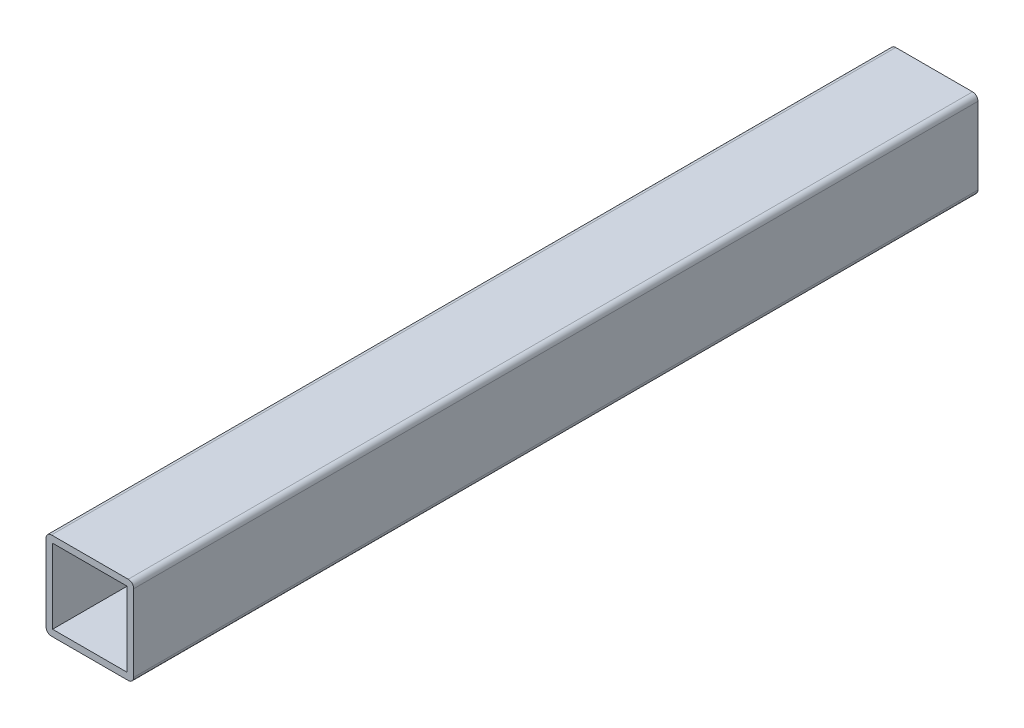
ISO-10303-21;
HEADER;
FILE_DESCRIPTION(('STEP AP214'),'2;1');
FILE_NAME('part.step','',(''),(''),'','','');
FILE_SCHEMA(('AUTOMOTIVE_DESIGN { 1 0 10303 214 1 1 1 1 }'));
ENDSEC;
DATA;
#1=APPLICATION_CONTEXT('core data for automotive mechanical design processes');
#2=APPLICATION_PROTOCOL_DEFINITION('international standard','automotive_design',2000,#1);
#3=PRODUCT_CONTEXT('',#1,'mechanical');
#4=PRODUCT('Part','Part','',(#3));
#5=PRODUCT_RELATED_PRODUCT_CATEGORY('part','',(#4));
#6=PRODUCT_DEFINITION_FORMATION('','',#4);
#7=PRODUCT_DEFINITION_CONTEXT('part definition',#1,'design');
#8=PRODUCT_DEFINITION('design','',#6,#7);
#9=PRODUCT_DEFINITION_SHAPE('','',#8);
#10=(LENGTH_UNIT() NAMED_UNIT(*) SI_UNIT(.MILLI.,.METRE.));
#11=(NAMED_UNIT(*) PLANE_ANGLE_UNIT() SI_UNIT($,.RADIAN.));
#12=(NAMED_UNIT(*) SI_UNIT($,.STERADIAN.) SOLID_ANGLE_UNIT());
#13=UNCERTAINTY_MEASURE_WITH_UNIT(LENGTH_MEASURE(1.E-05),#10,'distance_accuracy_value','');
#14=(GEOMETRIC_REPRESENTATION_CONTEXT(3) GLOBAL_UNCERTAINTY_ASSIGNED_CONTEXT((#13)) GLOBAL_UNIT_ASSIGNED_CONTEXT((#10,
#11,#12)) REPRESENTATION_CONTEXT('',''));
#15=CARTESIAN_POINT('',(0.,0.,0.));
#16=DIRECTION('',(0.,0.,1.));
#17=DIRECTION('',(1.,0.,0.));
#18=AXIS2_PLACEMENT_3D('',#15,#16,#17);
#19=CARTESIAN_POINT('',(4.44089209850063E-13,-80.0000000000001,770.));
#20=DIRECTION('',(0.,0.,1.));
#21=DIRECTION('',(1.,0.,0.));
#22=AXIS2_PLACEMENT_3D('',#19,#20,#21);
#23=PLANE('',#22);
#24=DIRECTION('',(0.,-1.,0.));
#25=VECTOR('',#24,1.);
#26=CARTESIAN_POINT('',(0.,0.,770.));
#27=LINE('',#26,#25);
#28=CARTESIAN_POINT('',(0.,-5.00000000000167,770.));
#29=VERTEX_POINT('',#28);
#30=CARTESIAN_POINT('',(0.,-75.0000000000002,770.));
#31=VERTEX_POINT('',#30);
#32=EDGE_CURVE('E224',#29,#31,#27,.T.);
#33=ORIENTED_EDGE('',*,*,#32,.T.);
#34=CARTESIAN_POINT('',(5.00000000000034,-75.0000000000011,770.));
#35=DIRECTION('',(0.,0.,1.));
#36=DIRECTION('',(1.,0.,0.));
#37=AXIS2_PLACEMENT_3D('',#34,#35,#36);
#38=CIRCLE('',#37,5.);
#39=CARTESIAN_POINT('',(5.00000000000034,-80.000000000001,770.));
#40=VERTEX_POINT('',#39);
#41=EDGE_CURVE('E257',#31,#40,#38,.T.);
#42=ORIENTED_EDGE('',*,*,#41,.T.);
#43=DIRECTION('',(1.,0.,0.));
#44=VECTOR('',#43,1.);
#45=CARTESIAN_POINT('',(4.44089209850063E-13,-80.0000000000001,770.));
#46=LINE('',#45,#44);
#47=CARTESIAN_POINT('',(75.0000000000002,-80.0000000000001,770.));
#48=VERTEX_POINT('',#47);
#49=EDGE_CURVE('E227',#40,#48,#46,.T.);
#50=ORIENTED_EDGE('',*,*,#49,.T.);
#51=CARTESIAN_POINT('',(75.0000000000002,-75.0000000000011,770.));
#52=DIRECTION('',(0.,0.,1.));
#53=DIRECTION('',(1.,0.,0.));
#54=AXIS2_PLACEMENT_3D('',#51,#52,#53);
#55=CIRCLE('',#54,5.);
#56=CARTESIAN_POINT('',(80.0000000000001,-75.0000000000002,770.));
#57=VERTEX_POINT('',#56);
#58=EDGE_CURVE('E255',#48,#57,#55,.T.);
#59=ORIENTED_EDGE('',*,*,#58,.T.);
#60=DIRECTION('',(0.,1.,0.));
#61=VECTOR('',#60,1.);
#62=CARTESIAN_POINT('',(79.9999999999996,-1.77635683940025E-12,770.));
#63=LINE('',#62,#61);
#64=CARTESIAN_POINT('',(80.0000000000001,-5.00000000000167,770.));
#65=VERTEX_POINT('',#64);
#66=EDGE_CURVE('E230',#57,#65,#63,.T.);
#67=ORIENTED_EDGE('',*,*,#66,.T.);
#68=CARTESIAN_POINT('',(75.0000000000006,-5.00000000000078,770.));
#69=DIRECTION('',(0.,0.,1.));
#70=DIRECTION('',(1.,0.,0.));
#71=AXIS2_PLACEMENT_3D('',#68,#69,#70);
#72=CIRCLE('',#71,5.);
#73=CARTESIAN_POINT('',(74.9999999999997,-1.77635683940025E-12,770.));
#74=VERTEX_POINT('',#73);
#75=EDGE_CURVE('E102',#65,#74,#72,.T.);
#76=ORIENTED_EDGE('',*,*,#75,.T.);
#77=DIRECTION('',(-1.,0.,0.));
#78=VECTOR('',#77,1.);
#79=CARTESIAN_POINT('',(0.,0.,770.));
#80=LINE('',#79,#78);
#81=CARTESIAN_POINT('',(4.99999999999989,0.,770.));
#82=VERTEX_POINT('',#81);
#83=EDGE_CURVE('E232',#74,#82,#80,.T.);
#84=ORIENTED_EDGE('',*,*,#83,.T.);
#85=CARTESIAN_POINT('',(4.99999999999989,-5.00000000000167,770.));
#86=DIRECTION('',(0.,0.,1.));
#87=DIRECTION('',(1.,0.,0.));
#88=AXIS2_PLACEMENT_3D('',#85,#86,#87);
#89=CIRCLE('',#88,5.);
#90=EDGE_CURVE('E252',#82,#29,#89,.T.);
#91=ORIENTED_EDGE('',*,*,#90,.T.);
#92=EDGE_LOOP('',(#33,#42,#50,#59,#67,#76,#84,#91));
#93=FACE_BOUND('',#92,.T.);
#94=DIRECTION('',(1.,0.,0.));
#95=VECTOR('',#94,1.);
#96=CARTESIAN_POINT('',(4.44089209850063E-13,-74.0000000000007,770.));
#97=LINE('',#96,#95);
#98=CARTESIAN_POINT('',(6.00000000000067,-73.9999999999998,770.));
#99=VERTEX_POINT('',#98);
#100=CARTESIAN_POINT('',(74.0000000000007,-74.0000000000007,770.));
#101=VERTEX_POINT('',#100);
#102=EDGE_CURVE('E202',#99,#101,#97,.T.);
#103=ORIENTED_EDGE('',*,*,#102,.F.);
#104=DIRECTION('',(0.,-1.,0.));
#105=VECTOR('',#104,1.);
#106=CARTESIAN_POINT('',(6.00000000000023,-8.88178419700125E-13,770.));
#107=LINE('',#106,#105);
#108=CARTESIAN_POINT('',(6.00000000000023,-6.00000000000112,770.));
#109=VERTEX_POINT('',#108);
#110=EDGE_CURVE('E190',#109,#99,#107,.T.);
#111=ORIENTED_EDGE('',*,*,#110,.F.);
#112=DIRECTION('',(-1.,0.,0.));
#113=VECTOR('',#112,1.);
#114=CARTESIAN_POINT('',(4.44089209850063E-13,-6.00000000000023,770.));
#115=LINE('',#114,#113);
#116=CARTESIAN_POINT('',(74.0000000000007,-6.00000000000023,770.));
#117=VERTEX_POINT('',#116);
#118=EDGE_CURVE('E207',#117,#109,#115,.T.);
#119=ORIENTED_EDGE('',*,*,#118,.F.);
#120=DIRECTION('',(0.,1.,0.));
#121=VECTOR('',#120,1.);
#122=CARTESIAN_POINT('',(74.0000000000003,-8.88178419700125E-13,770.));
#123=LINE('',#122,#121);
#124=EDGE_CURVE('E204',#101,#117,#123,.T.);
#125=ORIENTED_EDGE('',*,*,#124,.F.);
#126=EDGE_LOOP('',(#103,#111,#119,#125));
#127=FACE_BOUND('',#126,.T.);
#128=ADVANCED_FACE('F81',(#93,#127),#23,.T.);
#129=CARTESIAN_POINT('',(4.44089209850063E-13,-80.0000000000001,1.11022302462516E-13));
#130=DIRECTION('',(0.,0.,1.));
#131=DIRECTION('',(1.,0.,0.));
#132=AXIS2_PLACEMENT_3D('',#129,#130,#131);
#133=PLANE('',#132);
#134=DIRECTION('',(1.,0.,0.));
#135=VECTOR('',#134,1.);
#136=CARTESIAN_POINT('',(4.44089209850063E-13,-80.0000000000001,1.11022302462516E-13));
#137=LINE('',#136,#135);
#138=CARTESIAN_POINT('',(5.00000000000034,-80.0000000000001,1.11022302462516E-13));
#139=VERTEX_POINT('',#138);
#140=CARTESIAN_POINT('',(75.0000000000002,-80.0000000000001,0.));
#141=VERTEX_POINT('',#140);
#142=EDGE_CURVE('E216',#139,#141,#137,.T.);
#143=ORIENTED_EDGE('',*,*,#142,.F.);
#144=CARTESIAN_POINT('',(5.00000000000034,-75.0000000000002,1.11022302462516E-13));
#145=DIRECTION('',(0.,0.,1.));
#146=DIRECTION('',(1.,0.,0.));
#147=AXIS2_PLACEMENT_3D('',#144,#145,#146);
#148=CIRCLE('',#147,5.);
#149=CARTESIAN_POINT('',(4.44089209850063E-13,-75.0000000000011,1.11022302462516E-13));
#150=VERTEX_POINT('',#149);
#151=EDGE_CURVE('E245',#139,#150,#148,.F.);
#152=ORIENTED_EDGE('',*,*,#151,.T.);
#153=DIRECTION('',(0.,-1.,0.));
#154=VECTOR('',#153,1.);
#155=CARTESIAN_POINT('',(0.,0.,0.));
#156=LINE('',#155,#154);
#157=CARTESIAN_POINT('',(0.,-5.00000000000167,1.11022302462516E-13));
#158=VERTEX_POINT('',#157);
#159=EDGE_CURVE('E191',#158,#150,#156,.T.);
#160=ORIENTED_EDGE('',*,*,#159,.F.);
#161=CARTESIAN_POINT('',(5.00000000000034,-5.00000000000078,1.11022302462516E-13));
#162=DIRECTION('',(0.,0.,1.));
#163=DIRECTION('',(1.,0.,0.));
#164=AXIS2_PLACEMENT_3D('',#161,#162,#163);
#165=CIRCLE('',#164,5.);
#166=CARTESIAN_POINT('',(4.99999999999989,0.,0.));
#167=VERTEX_POINT('',#166);
#168=EDGE_CURVE('E239',#158,#167,#165,.F.);
#169=ORIENTED_EDGE('',*,*,#168,.T.);
#170=DIRECTION('',(-1.,0.,0.));
#171=VECTOR('',#170,1.);
#172=CARTESIAN_POINT('',(0.,0.,0.));
#173=LINE('',#172,#171);
#174=CARTESIAN_POINT('',(75.0000000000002,-8.88178419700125E-13,1.11022302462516E-13));
#175=VERTEX_POINT('',#174);
#176=EDGE_CURVE('E222',#175,#167,#173,.T.);
#177=ORIENTED_EDGE('',*,*,#176,.F.);
#178=CARTESIAN_POINT('',(75.0000000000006,-5.00000000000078,1.11022302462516E-13));
#179=DIRECTION('',(0.,0.,1.));
#180=DIRECTION('',(1.,0.,0.));
#181=AXIS2_PLACEMENT_3D('',#178,#179,#180);
#182=CIRCLE('',#181,5.);
#183=CARTESIAN_POINT('',(80.0000000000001,-5.00000000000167,0.));
#184=VERTEX_POINT('',#183);
#185=EDGE_CURVE('E241',#175,#184,#182,.F.);
#186=ORIENTED_EDGE('',*,*,#185,.T.);
#187=DIRECTION('',(0.,1.,0.));
#188=VECTOR('',#187,1.);
#189=CARTESIAN_POINT('',(80.0000000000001,-1.77635683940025E-12,1.11022302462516E-13));
#190=LINE('',#189,#188);
#191=CARTESIAN_POINT('',(80.0000000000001,-75.0000000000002,1.11022302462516E-13));
#192=VERTEX_POINT('',#191);
#193=EDGE_CURVE('E219',#192,#184,#190,.T.);
#194=ORIENTED_EDGE('',*,*,#193,.F.);
#195=CARTESIAN_POINT('',(75.0000000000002,-75.0000000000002,1.11022302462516E-13));
#196=DIRECTION('',(0.,0.,1.));
#197=DIRECTION('',(1.,0.,0.));
#198=AXIS2_PLACEMENT_3D('',#195,#196,#197);
#199=CIRCLE('',#198,5.);
#200=EDGE_CURVE('E243',#192,#141,#199,.F.);
#201=ORIENTED_EDGE('',*,*,#200,.T.);
#202=EDGE_LOOP('',(#143,#152,#160,#169,#177,#186,#194,#201));
#203=FACE_BOUND('',#202,.T.);
#204=DIRECTION('',(0.,-1.,0.));
#205=VECTOR('',#204,1.);
#206=CARTESIAN_POINT('',(5.99999999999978,-1.77635683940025E-12,0.));
#207=LINE('',#206,#205);
#208=CARTESIAN_POINT('',(6.00000000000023,-6.00000000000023,1.11022302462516E-13));
#209=VERTEX_POINT('',#208);
#210=CARTESIAN_POINT('',(5.99999999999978,-74.0000000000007,1.11022302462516E-13));
#211=VERTEX_POINT('',#210);
#212=EDGE_CURVE('E183',#209,#211,#207,.T.);
#213=ORIENTED_EDGE('',*,*,#212,.T.);
#214=DIRECTION('',(1.,0.,0.));
#215=VECTOR('',#214,1.);
#216=CARTESIAN_POINT('',(4.44089209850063E-13,-74.0000000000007,0.));
#217=LINE('',#216,#215);
#218=CARTESIAN_POINT('',(74.0000000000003,-74.0000000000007,1.11022302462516E-13));
#219=VERTEX_POINT('',#218);
#220=EDGE_CURVE('E171',#211,#219,#217,.T.);
#221=ORIENTED_EDGE('',*,*,#220,.T.);
#222=DIRECTION('',(0.,1.,0.));
#223=VECTOR('',#222,1.);
#224=CARTESIAN_POINT('',(74.0000000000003,0.,1.11022302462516E-13));
#225=LINE('',#224,#223);
#226=CARTESIAN_POINT('',(73.9999999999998,-6.000000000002,0.));
#227=VERTEX_POINT('',#226);
#228=EDGE_CURVE('E182',#219,#227,#225,.T.);
#229=ORIENTED_EDGE('',*,*,#228,.T.);
#230=DIRECTION('',(-1.,0.,0.));
#231=VECTOR('',#230,1.);
#232=CARTESIAN_POINT('',(4.44089209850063E-13,-6.00000000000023,1.11022302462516E-13));
#233=LINE('',#232,#231);
#234=EDGE_CURVE('E196',#227,#209,#233,.T.);
#235=ORIENTED_EDGE('',*,*,#234,.T.);
#236=EDGE_LOOP('',(#213,#221,#229,#235));
#237=FACE_BOUND('',#236,.T.);
#238=ADVANCED_FACE('F194',(#203,#237),#133,.F.);
#239=CARTESIAN_POINT('',(0.,0.,770.));
#240=DIRECTION('',(1.,0.,0.));
#241=DIRECTION('',(0.,1.,0.));
#242=AXIS2_PLACEMENT_3D('',#239,#240,#241);
#243=PLANE('',#242);
#244=ORIENTED_EDGE('',*,*,#159,.T.);
#245=DIRECTION('',(0.,0.,-1.));
#246=VECTOR('',#245,1.);
#247=CARTESIAN_POINT('',(0.,-75.0000000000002,770.));
#248=LINE('',#247,#246);
#249=EDGE_CURVE('E250',#150,#31,#248,.F.);
#250=ORIENTED_EDGE('',*,*,#249,.T.);
#251=ORIENTED_EDGE('',*,*,#32,.F.);
#252=DIRECTION('',(0.,0.,-1.));
#253=VECTOR('',#252,1.);
#254=CARTESIAN_POINT('',(0.,-5.00000000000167,770.));
#255=LINE('',#254,#253);
#256=EDGE_CURVE('E247',#29,#158,#255,.T.);
#257=ORIENTED_EDGE('',*,*,#256,.T.);
#258=EDGE_LOOP('',(#244,#250,#251,#257));
#259=FACE_BOUND('',#258,.T.);
#260=ADVANCED_FACE('F83',(#259),#243,.F.);
#261=CARTESIAN_POINT('',(4.44089209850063E-13,-80.0000000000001,770.));
#262=DIRECTION('',(0.,1.,0.));
#263=DIRECTION('',(0.,0.,1.));
#264=AXIS2_PLACEMENT_3D('',#261,#262,#263);
#265=PLANE('',#264);
#266=ORIENTED_EDGE('',*,*,#49,.F.);
#267=DIRECTION('',(0.,0.,-1.));
#268=VECTOR('',#267,1.);
#269=CARTESIAN_POINT('',(5.00000000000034,-80.000000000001,770.));
#270=LINE('',#269,#268);
#271=EDGE_CURVE('E236',#40,#139,#270,.T.);
#272=ORIENTED_EDGE('',*,*,#271,.T.);
#273=ORIENTED_EDGE('',*,*,#142,.T.);
#274=DIRECTION('',(0.,0.,-1.));
#275=VECTOR('',#274,1.);
#276=CARTESIAN_POINT('',(75.0000000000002,-80.0000000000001,770.));
#277=LINE('',#276,#275);
#278=EDGE_CURVE('E234',#141,#48,#277,.F.);
#279=ORIENTED_EDGE('',*,*,#278,.T.);
#280=EDGE_LOOP('',(#266,#272,#273,#279));
#281=FACE_BOUND('',#280,.T.);
#282=ADVANCED_FACE('F293',(#281),#265,.F.);
#283=CARTESIAN_POINT('',(79.9999999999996,-1.77635683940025E-12,770.));
#284=DIRECTION('',(-1.,0.,0.));
#285=DIRECTION('',(0.,-1.,0.));
#286=AXIS2_PLACEMENT_3D('',#283,#284,#285);
#287=PLANE('',#286);
#288=ORIENTED_EDGE('',*,*,#66,.F.);
#289=DIRECTION('',(0.,0.,-1.));
#290=VECTOR('',#289,1.);
#291=CARTESIAN_POINT('',(80.0000000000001,-75.0000000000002,770.));
#292=LINE('',#291,#290);
#293=EDGE_CURVE('E261',#57,#192,#292,.T.);
#294=ORIENTED_EDGE('',*,*,#293,.T.);
#295=ORIENTED_EDGE('',*,*,#193,.T.);
#296=DIRECTION('',(0.,0.,-1.));
#297=VECTOR('',#296,1.);
#298=CARTESIAN_POINT('',(80.0000000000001,-5.00000000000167,770.));
#299=LINE('',#298,#297);
#300=EDGE_CURVE('E259',#184,#65,#299,.F.);
#301=ORIENTED_EDGE('',*,*,#300,.T.);
#302=EDGE_LOOP('',(#288,#294,#295,#301));
#303=FACE_BOUND('',#302,.T.);
#304=ADVANCED_FACE('F267',(#303),#287,.F.);
#305=CARTESIAN_POINT('',(0.,0.,770.));
#306=DIRECTION('',(0.,-1.,0.));
#307=DIRECTION('',(0.,0.,-1.));
#308=AXIS2_PLACEMENT_3D('',#305,#306,#307);
#309=PLANE('',#308);
#310=ORIENTED_EDGE('',*,*,#83,.F.);
#311=DIRECTION('',(0.,0.,-1.));
#312=VECTOR('',#311,1.);
#313=CARTESIAN_POINT('',(74.9999999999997,-1.77635683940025E-12,770.));
#314=LINE('',#313,#312);
#315=EDGE_CURVE('E12',#74,#175,#314,.T.);
#316=ORIENTED_EDGE('',*,*,#315,.T.);
#317=ORIENTED_EDGE('',*,*,#176,.T.);
#318=DIRECTION('',(0.,0.,-1.));
#319=VECTOR('',#318,1.);
#320=CARTESIAN_POINT('',(4.99999999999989,0.,770.));
#321=LINE('',#320,#319);
#322=EDGE_CURVE('E89',#167,#82,#321,.F.);
#323=ORIENTED_EDGE('',*,*,#322,.T.);
#324=EDGE_LOOP('',(#310,#316,#317,#323));
#325=FACE_BOUND('',#324,.T.);
#326=ADVANCED_FACE('F277',(#325),#309,.F.);
#327=CARTESIAN_POINT('',(6.00000000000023,-8.88178419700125E-13,770.));
#328=DIRECTION('',(1.,0.,0.));
#329=DIRECTION('',(0.,1.,0.));
#330=AXIS2_PLACEMENT_3D('',#327,#328,#329);
#331=PLANE('',#330);
#332=ORIENTED_EDGE('',*,*,#212,.F.);
#333=DIRECTION('',(0.,0.,-1.));
#334=VECTOR('',#333,1.);
#335=CARTESIAN_POINT('',(6.00000000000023,-6.00000000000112,770.));
#336=LINE('',#335,#334);
#337=EDGE_CURVE('E209',#109,#209,#336,.T.);
#338=ORIENTED_EDGE('',*,*,#337,.F.);
#339=ORIENTED_EDGE('',*,*,#110,.T.);
#340=DIRECTION('',(0.,0.,-1.));
#341=VECTOR('',#340,1.);
#342=CARTESIAN_POINT('',(6.00000000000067,-73.9999999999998,770.));
#343=LINE('',#342,#341);
#344=EDGE_CURVE('E174',#99,#211,#343,.T.);
#345=ORIENTED_EDGE('',*,*,#344,.T.);
#346=EDGE_LOOP('',(#332,#338,#339,#345));
#347=FACE_BOUND('',#346,.T.);
#348=ADVANCED_FACE('F186',(#347),#331,.T.);
#349=CARTESIAN_POINT('',(4.44089209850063E-13,-74.0000000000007,770.));
#350=DIRECTION('',(0.,1.,0.));
#351=DIRECTION('',(0.,0.,1.));
#352=AXIS2_PLACEMENT_3D('',#349,#350,#351);
#353=PLANE('',#352);
#354=ORIENTED_EDGE('',*,*,#220,.F.);
#355=ORIENTED_EDGE('',*,*,#344,.F.);
#356=ORIENTED_EDGE('',*,*,#102,.T.);
#357=DIRECTION('',(0.,0.,-1.));
#358=VECTOR('',#357,1.);
#359=CARTESIAN_POINT('',(74.0000000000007,-74.0000000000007,770.));
#360=LINE('',#359,#358);
#361=EDGE_CURVE('E177',#101,#219,#360,.T.);
#362=ORIENTED_EDGE('',*,*,#361,.T.);
#363=EDGE_LOOP('',(#354,#355,#356,#362));
#364=FACE_BOUND('',#363,.T.);
#365=ADVANCED_FACE('F173',(#364),#353,.T.);
#366=CARTESIAN_POINT('',(74.0000000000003,-8.88178419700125E-13,770.));
#367=DIRECTION('',(-1.,0.,0.));
#368=DIRECTION('',(0.,-1.,0.));
#369=AXIS2_PLACEMENT_3D('',#366,#367,#368);
#370=PLANE('',#369);
#371=ORIENTED_EDGE('',*,*,#228,.F.);
#372=ORIENTED_EDGE('',*,*,#361,.F.);
#373=ORIENTED_EDGE('',*,*,#124,.T.);
#374=DIRECTION('',(0.,0.,-1.));
#375=VECTOR('',#374,1.);
#376=CARTESIAN_POINT('',(74.0000000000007,-6.00000000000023,770.));
#377=LINE('',#376,#375);
#378=EDGE_CURVE('E211',#117,#227,#377,.T.);
#379=ORIENTED_EDGE('',*,*,#378,.T.);
#380=EDGE_LOOP('',(#371,#372,#373,#379));
#381=FACE_BOUND('',#380,.T.);
#382=ADVANCED_FACE('F362',(#381),#370,.T.);
#383=CARTESIAN_POINT('',(4.44089209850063E-13,-6.00000000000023,770.));
#384=DIRECTION('',(0.,-1.,0.));
#385=DIRECTION('',(0.,0.,-1.));
#386=AXIS2_PLACEMENT_3D('',#383,#384,#385);
#387=PLANE('',#386);
#388=ORIENTED_EDGE('',*,*,#234,.F.);
#389=ORIENTED_EDGE('',*,*,#378,.F.);
#390=ORIENTED_EDGE('',*,*,#118,.T.);
#391=ORIENTED_EDGE('',*,*,#337,.T.);
#392=EDGE_LOOP('',(#388,#389,#390,#391));
#393=FACE_BOUND('',#392,.T.);
#394=ADVANCED_FACE('F303',(#393),#387,.T.);
#395=CARTESIAN_POINT('',(5.00000000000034,-75.0000000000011,770.));
#396=DIRECTION('',(0.,0.,-1.));
#397=DIRECTION('',(-1.,0.,0.));
#398=AXIS2_PLACEMENT_3D('',#395,#396,#397);
#399=CYLINDRICAL_SURFACE('',#398,5.);
#400=ORIENTED_EDGE('',*,*,#41,.F.);
#401=ORIENTED_EDGE('',*,*,#249,.F.);
#402=ORIENTED_EDGE('',*,*,#151,.F.);
#403=ORIENTED_EDGE('',*,*,#271,.F.);
#404=EDGE_LOOP('',(#400,#401,#402,#403));
#405=FACE_BOUND('',#404,.T.);
#406=ADVANCED_FACE('F290',(#405),#399,.T.);
#407=CARTESIAN_POINT('',(75.0000000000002,-75.0000000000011,770.));
#408=DIRECTION('',(0.,0.,-1.));
#409=DIRECTION('',(-1.,0.,0.));
#410=AXIS2_PLACEMENT_3D('',#407,#408,#409);
#411=CYLINDRICAL_SURFACE('',#410,5.);
#412=ORIENTED_EDGE('',*,*,#58,.F.);
#413=ORIENTED_EDGE('',*,*,#278,.F.);
#414=ORIENTED_EDGE('',*,*,#200,.F.);
#415=ORIENTED_EDGE('',*,*,#293,.F.);
#416=EDGE_LOOP('',(#412,#413,#414,#415));
#417=FACE_BOUND('',#416,.T.);
#418=ADVANCED_FACE('F295',(#417),#411,.T.);
#419=CARTESIAN_POINT('',(75.0000000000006,-5.00000000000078,770.));
#420=DIRECTION('',(0.,0.,-1.));
#421=DIRECTION('',(-1.,0.,0.));
#422=AXIS2_PLACEMENT_3D('',#419,#420,#421);
#423=CYLINDRICAL_SURFACE('',#422,5.);
#424=ORIENTED_EDGE('',*,*,#75,.F.);
#425=ORIENTED_EDGE('',*,*,#300,.F.);
#426=ORIENTED_EDGE('',*,*,#185,.F.);
#427=ORIENTED_EDGE('',*,*,#315,.F.);
#428=EDGE_LOOP('',(#424,#425,#426,#427));
#429=FACE_BOUND('',#428,.T.);
#430=ADVANCED_FACE('F276',(#429),#423,.T.);
#431=CARTESIAN_POINT('',(4.99999999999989,-5.00000000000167,770.));
#432=DIRECTION('',(0.,0.,-1.));
#433=DIRECTION('',(-1.,0.,0.));
#434=AXIS2_PLACEMENT_3D('',#431,#432,#433);
#435=CYLINDRICAL_SURFACE('',#434,5.);
#436=ORIENTED_EDGE('',*,*,#90,.F.);
#437=ORIENTED_EDGE('',*,*,#322,.F.);
#438=ORIENTED_EDGE('',*,*,#168,.F.);
#439=ORIENTED_EDGE('',*,*,#256,.F.);
#440=EDGE_LOOP('',(#436,#437,#438,#439));
#441=FACE_BOUND('',#440,.T.);
#442=ADVANCED_FACE('F283',(#441),#435,.T.);
#443=CLOSED_SHELL('',(#128,#238,#260,#282,#304,#326,#348,#365,#382,#394,#406,#418,#430,#442));
#444=MANIFOLD_SOLID_BREP('B2',#443);
#445=ADVANCED_BREP_SHAPE_REPRESENTATION('',(#18,#444),#14);
#446=SHAPE_DEFINITION_REPRESENTATION(#9,#445);
ENDSEC;
END-ISO-10303-21;
